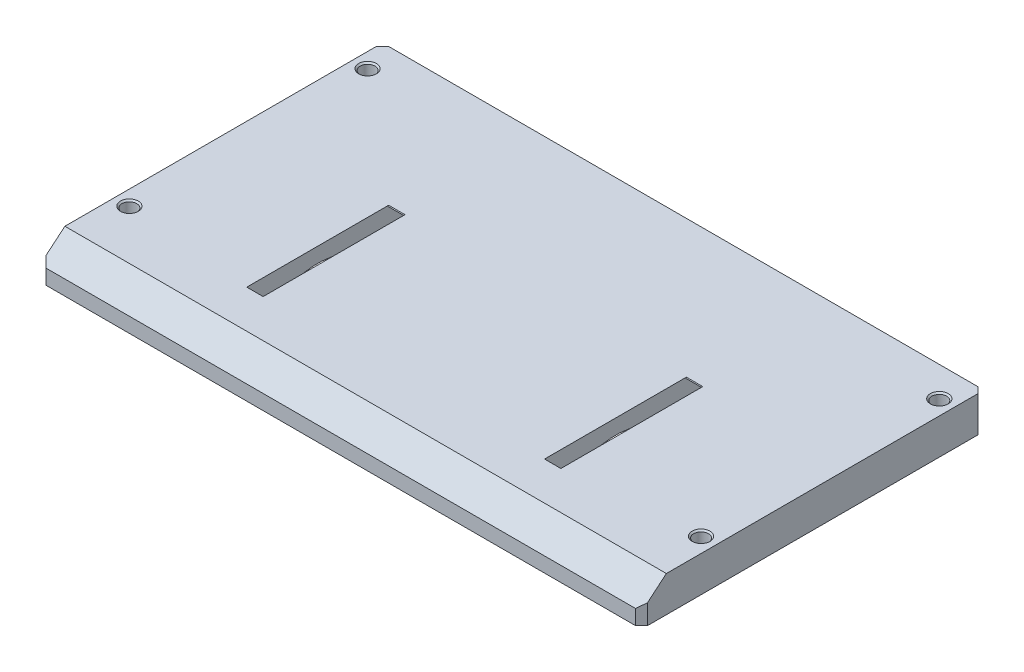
ISO-10303-21;
HEADER;
FILE_DESCRIPTION(('STEP AP214'),'2;1');
FILE_NAME('part.step','',(''),(''),'','','');
FILE_SCHEMA(('AUTOMOTIVE_DESIGN { 1 0 10303 214 1 1 1 1 }'));
ENDSEC;
DATA;
#1=APPLICATION_CONTEXT('core data for automotive mechanical design processes');
#2=APPLICATION_PROTOCOL_DEFINITION('international standard','automotive_design',2000,#1);
#3=PRODUCT_CONTEXT('',#1,'mechanical');
#4=PRODUCT('Part','Part','',(#3));
#5=PRODUCT_RELATED_PRODUCT_CATEGORY('part','',(#4));
#6=PRODUCT_DEFINITION_FORMATION('','',#4);
#7=PRODUCT_DEFINITION_CONTEXT('part definition',#1,'design');
#8=PRODUCT_DEFINITION('design','',#6,#7);
#9=PRODUCT_DEFINITION_SHAPE('','',#8);
#10=(LENGTH_UNIT() NAMED_UNIT(*) SI_UNIT(.MILLI.,.METRE.));
#11=(NAMED_UNIT(*) PLANE_ANGLE_UNIT() SI_UNIT($,.RADIAN.));
#12=(NAMED_UNIT(*) SI_UNIT($,.STERADIAN.) SOLID_ANGLE_UNIT());
#13=UNCERTAINTY_MEASURE_WITH_UNIT(LENGTH_MEASURE(1.E-05),#10,'distance_accuracy_value','');
#14=(GEOMETRIC_REPRESENTATION_CONTEXT(3) GLOBAL_UNCERTAINTY_ASSIGNED_CONTEXT((#13)) GLOBAL_UNIT_ASSIGNED_CONTEXT((#10,
#11,#12)) REPRESENTATION_CONTEXT('',''));
#15=CARTESIAN_POINT('',(0.,0.,0.));
#16=DIRECTION('',(0.,0.,1.));
#17=DIRECTION('',(1.,0.,0.));
#18=AXIS2_PLACEMENT_3D('',#15,#16,#17);
#19=CARTESIAN_POINT('',(0.,12.,0.));
#20=DIRECTION('',(0.,1.,0.));
#21=DIRECTION('',(0.,0.,1.));
#22=AXIS2_PLACEMENT_3D('',#19,#20,#21);
#23=PLANE('',#22);
#24=CARTESIAN_POINT('',(96.,12.,32.5));
#25=DIRECTION('',(0.,1.,0.));
#26=DIRECTION('',(0.,0.,1.));
#27=AXIS2_PLACEMENT_3D('',#24,#25,#26);
#28=CIRCLE('',#27,3.00000000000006);
#29=CARTESIAN_POINT('',(96.,12.,35.5));
#30=VERTEX_POINT('',#29);
#31=EDGE_CURVE('E388',#30,#30,#28,.F.);
#32=ORIENTED_EDGE('',*,*,#31,.T.);
#33=EDGE_LOOP('',(#32));
#34=FACE_BOUND('',#33,.T.);
#35=CARTESIAN_POINT('',(96.,12.,-47.5));
#36=DIRECTION('',(0.,1.,0.));
#37=DIRECTION('',(0.,0.,1.));
#38=AXIS2_PLACEMENT_3D('',#35,#36,#37);
#39=CIRCLE('',#38,3.00000000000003);
#40=CARTESIAN_POINT('',(96.,12.,-44.5));
#41=VERTEX_POINT('',#40);
#42=EDGE_CURVE('E385',#41,#41,#39,.F.);
#43=ORIENTED_EDGE('',*,*,#42,.T.);
#44=EDGE_LOOP('',(#43));
#45=FACE_BOUND('',#44,.T.);
#46=CARTESIAN_POINT('',(-96.,12.,32.5));
#47=DIRECTION('',(0.,1.,0.));
#48=DIRECTION('',(0.,0.,1.));
#49=AXIS2_PLACEMENT_3D('',#46,#47,#48);
#50=CIRCLE('',#49,3.00000000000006);
#51=CARTESIAN_POINT('',(-96.,12.,35.5));
#52=VERTEX_POINT('',#51);
#53=EDGE_CURVE('E382',#52,#52,#50,.F.);
#54=ORIENTED_EDGE('',*,*,#53,.T.);
#55=EDGE_LOOP('',(#54));
#56=FACE_BOUND('',#55,.T.);
#57=CARTESIAN_POINT('',(-96.,12.,-47.5));
#58=DIRECTION('',(0.,1.,0.));
#59=DIRECTION('',(0.,0.,1.));
#60=AXIS2_PLACEMENT_3D('',#57,#58,#59);
#61=CIRCLE('',#60,3.00000000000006);
#62=CARTESIAN_POINT('',(-96.,12.,-44.5));
#63=VERTEX_POINT('',#62);
#64=EDGE_CURVE('E379',#63,#63,#61,.F.);
#65=ORIENTED_EDGE('',*,*,#64,.T.);
#66=EDGE_LOOP('',(#65));
#67=FACE_BOUND('',#66,.T.);
#68=DIRECTION('',(0.,0.,1.));
#69=VECTOR('',#68,1.);
#70=CARTESIAN_POINT('',(-101.,12.,57.5));
#71=LINE('',#70,#69);
#72=CARTESIAN_POINT('',(-101.,12.,-55.5));
#73=VERTEX_POINT('',#72);
#74=CARTESIAN_POINT('',(-101.,12.,49.1577248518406));
#75=VERTEX_POINT('',#74);
#76=EDGE_CURVE('E338',#73,#75,#71,.T.);
#77=ORIENTED_EDGE('',*,*,#76,.T.);
#78=DIRECTION('',(1.,0.,0.));
#79=VECTOR('',#78,1.);
#80=CARTESIAN_POINT('',(99.,12.,49.1577248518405));
#81=LINE('',#80,#79);
#82=CARTESIAN_POINT('',(101.,12.,49.1577248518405));
#83=VERTEX_POINT('',#82);
#84=EDGE_CURVE('E271',#75,#83,#81,.T.);
#85=ORIENTED_EDGE('',*,*,#84,.T.);
#86=DIRECTION('',(0.,0.,-1.));
#87=VECTOR('',#86,1.);
#88=CARTESIAN_POINT('',(101.,12.,57.5));
#89=LINE('',#88,#87);
#90=CARTESIAN_POINT('',(101.,12.,-55.5));
#91=VERTEX_POINT('',#90);
#92=EDGE_CURVE('E341',#83,#91,#89,.T.);
#93=ORIENTED_EDGE('',*,*,#92,.T.);
#94=DIRECTION('',(0.707106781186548,0.,0.707106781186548));
#95=VECTOR('',#94,1.);
#96=CARTESIAN_POINT('',(78.25,12.,-78.25));
#97=LINE('',#96,#95);
#98=CARTESIAN_POINT('',(99.,12.,-57.5));
#99=VERTEX_POINT('',#98);
#100=EDGE_CURVE('E430',#91,#99,#97,.F.);
#101=ORIENTED_EDGE('',*,*,#100,.T.);
#102=DIRECTION('',(-1.,0.,0.));
#103=VECTOR('',#102,1.);
#104=CARTESIAN_POINT('',(101.,12.,-57.5));
#105=LINE('',#104,#103);
#106=CARTESIAN_POINT('',(-99.,12.,-57.5));
#107=VERTEX_POINT('',#106);
#108=EDGE_CURVE('E344',#99,#107,#105,.T.);
#109=ORIENTED_EDGE('',*,*,#108,.T.);
#110=DIRECTION('',(0.707106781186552,0.,-0.707106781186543));
#111=VECTOR('',#110,1.);
#112=CARTESIAN_POINT('',(-78.2499999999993,12.,-78.2500000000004));
#113=LINE('',#112,#111);
#114=EDGE_CURVE('E432',#107,#73,#113,.F.);
#115=ORIENTED_EDGE('',*,*,#114,.T.);
#116=EDGE_LOOP('',(#77,#85,#93,#101,#109,#115));
#117=FACE_BOUND('',#116,.T.);
#118=DIRECTION('',(0.,0.,-1.));
#119=VECTOR('',#118,1.);
#120=CARTESIAN_POINT('',(47.25,12.,0.));
#121=LINE('',#120,#119);
#122=CARTESIAN_POINT('',(47.25,12.,36.3238075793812));
#123=VERTEX_POINT('',#122);
#124=CARTESIAN_POINT('',(47.25,12.,-11.3238075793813));
#125=VERTEX_POINT('',#124);
#126=EDGE_CURVE('E335',#123,#125,#121,.T.);
#127=ORIENTED_EDGE('',*,*,#126,.T.);
#128=DIRECTION('',(1.,0.,0.));
#129=VECTOR('',#128,1.);
#130=CARTESIAN_POINT('',(52.75,12.,-11.3238075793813));
#131=LINE('',#130,#129);
#132=CARTESIAN_POINT('',(52.75,12.,-11.3238075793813));
#133=VERTEX_POINT('',#132);
#134=EDGE_CURVE('E484',#125,#133,#131,.T.);
#135=ORIENTED_EDGE('',*,*,#134,.T.);
#136=DIRECTION('',(0.,0.,-1.));
#137=VECTOR('',#136,1.);
#138=CARTESIAN_POINT('',(52.75,12.,0.));
#139=LINE('',#138,#137);
#140=CARTESIAN_POINT('',(52.75,12.,36.3238075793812));
#141=VERTEX_POINT('',#140);
#142=EDGE_CURVE('E333',#141,#133,#139,.T.);
#143=ORIENTED_EDGE('',*,*,#142,.F.);
#144=DIRECTION('',(-1.,0.,0.));
#145=VECTOR('',#144,1.);
#146=CARTESIAN_POINT('',(47.25,12.,36.3238075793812));
#147=LINE('',#146,#145);
#148=EDGE_CURVE('E481',#141,#123,#147,.T.);
#149=ORIENTED_EDGE('',*,*,#148,.T.);
#150=EDGE_LOOP('',(#127,#135,#143,#149));
#151=FACE_BOUND('',#150,.T.);
#152=DIRECTION('',(-1.,0.,0.));
#153=VECTOR('',#152,1.);
#154=CARTESIAN_POINT('',(0.,12.,36.3238075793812));
#155=LINE('',#154,#153);
#156=CARTESIAN_POINT('',(-47.25,12.,36.3238075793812));
#157=VERTEX_POINT('',#156);
#158=CARTESIAN_POINT('',(-52.75,12.,36.3238075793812));
#159=VERTEX_POINT('',#158);
#160=EDGE_CURVE('E490',#157,#159,#155,.T.);
#161=ORIENTED_EDGE('',*,*,#160,.T.);
#162=DIRECTION('',(0.,0.,1.));
#163=VECTOR('',#162,1.);
#164=CARTESIAN_POINT('',(-52.75,12.,0.));
#165=LINE('',#164,#163);
#166=CARTESIAN_POINT('',(-52.75,12.,-11.3238075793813));
#167=VERTEX_POINT('',#166);
#168=EDGE_CURVE('E321',#167,#159,#165,.T.);
#169=ORIENTED_EDGE('',*,*,#168,.F.);
#170=DIRECTION('',(1.,0.,0.));
#171=VECTOR('',#170,1.);
#172=CARTESIAN_POINT('',(0.,12.,-11.3238075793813));
#173=LINE('',#172,#171);
#174=CARTESIAN_POINT('',(-47.25,12.,-11.3238075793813));
#175=VERTEX_POINT('',#174);
#176=EDGE_CURVE('E487',#167,#175,#173,.T.);
#177=ORIENTED_EDGE('',*,*,#176,.T.);
#178=DIRECTION('',(0.,0.,1.));
#179=VECTOR('',#178,1.);
#180=CARTESIAN_POINT('',(-47.25,12.,0.));
#181=LINE('',#180,#179);
#182=EDGE_CURVE('E323',#175,#157,#181,.T.);
#183=ORIENTED_EDGE('',*,*,#182,.T.);
#184=EDGE_LOOP('',(#161,#169,#177,#183));
#185=FACE_BOUND('',#184,.T.);
#186=ADVANCED_FACE('F56',(#34,#45,#56,#67,#117,#151,#185),#23,.T.);
#187=CARTESIAN_POINT('',(0.,0.,0.));
#188=DIRECTION('',(0.,1.,0.));
#189=DIRECTION('',(0.,0.,1.));
#190=AXIS2_PLACEMENT_3D('',#187,#188,#189);
#191=PLANE('',#190);
#192=DIRECTION('',(0.,0.,1.));
#193=VECTOR('',#192,1.);
#194=CARTESIAN_POINT('',(-47.25,0.,0.));
#195=LINE('',#194,#193);
#196=CARTESIAN_POINT('',(-47.25,0.,29.8493515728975));
#197=VERTEX_POINT('',#196);
#198=CARTESIAN_POINT('',(-47.25,0.,46.466401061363));
#199=VERTEX_POINT('',#198);
#200=EDGE_CURVE('E454',#197,#199,#195,.T.);
#201=ORIENTED_EDGE('',*,*,#200,.F.);
#202=DIRECTION('',(1.,0.,0.));
#203=VECTOR('',#202,1.);
#204=CARTESIAN_POINT('',(-75.,0.,29.8493515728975));
#205=LINE('',#204,#203);
#206=CARTESIAN_POINT('',(47.25,0.,29.8493515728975));
#207=VERTEX_POINT('',#206);
#208=EDGE_CURVE('E293',#197,#207,#205,.T.);
#209=ORIENTED_EDGE('',*,*,#208,.T.);
#210=DIRECTION('',(0.,0.,-1.));
#211=VECTOR('',#210,1.);
#212=CARTESIAN_POINT('',(47.25,0.,0.));
#213=LINE('',#212,#211);
#214=CARTESIAN_POINT('',(47.25,0.,46.466401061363));
#215=VERTEX_POINT('',#214);
#216=EDGE_CURVE('E449',#215,#207,#213,.T.);
#217=ORIENTED_EDGE('',*,*,#216,.F.);
#218=DIRECTION('',(1.,0.,0.));
#219=VECTOR('',#218,1.);
#220=CARTESIAN_POINT('',(0.,0.,46.466401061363));
#221=LINE('',#220,#219);
#222=CARTESIAN_POINT('',(52.75,0.,46.466401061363));
#223=VERTEX_POINT('',#222);
#224=EDGE_CURVE('E462',#215,#223,#221,.T.);
#225=ORIENTED_EDGE('',*,*,#224,.T.);
#226=DIRECTION('',(0.,0.,-1.));
#227=VECTOR('',#226,1.);
#228=CARTESIAN_POINT('',(52.75,0.,0.));
#229=LINE('',#228,#227);
#230=CARTESIAN_POINT('',(52.75,0.,29.8493515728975));
#231=VERTEX_POINT('',#230);
#232=EDGE_CURVE('E445',#223,#231,#229,.T.);
#233=ORIENTED_EDGE('',*,*,#232,.T.);
#234=CARTESIAN_POINT('',(75.,0.,29.8493515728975));
#235=VERTEX_POINT('',#234);
#236=EDGE_CURVE('E292',#231,#235,#205,.T.);
#237=ORIENTED_EDGE('',*,*,#236,.T.);
#238=DIRECTION('',(0.,0.,-1.));
#239=VECTOR('',#238,1.);
#240=CARTESIAN_POINT('',(75.,0.,0.));
#241=LINE('',#240,#239);
#242=CARTESIAN_POINT('',(75.,0.,-4.8493515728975));
#243=VERTEX_POINT('',#242);
#244=EDGE_CURVE('E272',#235,#243,#241,.T.);
#245=ORIENTED_EDGE('',*,*,#244,.T.);
#246=DIRECTION('',(1.,0.,0.));
#247=VECTOR('',#246,1.);
#248=CARTESIAN_POINT('',(-75.,0.,-4.8493515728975));
#249=LINE('',#248,#247);
#250=CARTESIAN_POINT('',(52.75,0.,-4.8493515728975));
#251=VERTEX_POINT('',#250);
#252=EDGE_CURVE('E288',#243,#251,#249,.F.);
#253=ORIENTED_EDGE('',*,*,#252,.T.);
#254=CARTESIAN_POINT('',(52.75,0.,-21.4664010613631));
#255=VERTEX_POINT('',#254);
#256=EDGE_CURVE('E444',#251,#255,#229,.T.);
#257=ORIENTED_EDGE('',*,*,#256,.T.);
#258=DIRECTION('',(-1.,0.,0.));
#259=VECTOR('',#258,1.);
#260=CARTESIAN_POINT('',(0.,0.,-21.4664010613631));
#261=LINE('',#260,#259);
#262=CARTESIAN_POINT('',(47.25,0.,-21.4664010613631));
#263=VERTEX_POINT('',#262);
#264=EDGE_CURVE('E465',#255,#263,#261,.T.);
#265=ORIENTED_EDGE('',*,*,#264,.T.);
#266=CARTESIAN_POINT('',(47.25,0.,-4.8493515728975));
#267=VERTEX_POINT('',#266);
#268=EDGE_CURVE('E448',#267,#263,#213,.T.);
#269=ORIENTED_EDGE('',*,*,#268,.F.);
#270=CARTESIAN_POINT('',(-47.25,0.,-4.8493515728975));
#271=VERTEX_POINT('',#270);
#272=EDGE_CURVE('E289',#267,#271,#249,.F.);
#273=ORIENTED_EDGE('',*,*,#272,.T.);
#274=CARTESIAN_POINT('',(-47.25,0.,-21.4664010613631));
#275=VERTEX_POINT('',#274);
#276=EDGE_CURVE('E455',#275,#271,#195,.T.);
#277=ORIENTED_EDGE('',*,*,#276,.F.);
#278=DIRECTION('',(-1.,0.,0.));
#279=VECTOR('',#278,1.);
#280=CARTESIAN_POINT('',(-52.75,0.,-21.4664010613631));
#281=LINE('',#280,#279);
#282=CARTESIAN_POINT('',(-52.75,0.,-21.4664010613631));
#283=VERTEX_POINT('',#282);
#284=EDGE_CURVE('E473',#275,#283,#281,.T.);
#285=ORIENTED_EDGE('',*,*,#284,.T.);
#286=DIRECTION('',(0.,0.,1.));
#287=VECTOR('',#286,1.);
#288=CARTESIAN_POINT('',(-52.75,0.,0.));
#289=LINE('',#288,#287);
#290=CARTESIAN_POINT('',(-52.75,0.,-4.8493515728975));
#291=VERTEX_POINT('',#290);
#292=EDGE_CURVE('E286',#283,#291,#289,.T.);
#293=ORIENTED_EDGE('',*,*,#292,.T.);
#294=CARTESIAN_POINT('',(-75.,0.,-4.8493515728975));
#295=VERTEX_POINT('',#294);
#296=EDGE_CURVE('E276',#291,#295,#249,.F.);
#297=ORIENTED_EDGE('',*,*,#296,.T.);
#298=DIRECTION('',(0.,0.,-1.));
#299=VECTOR('',#298,1.);
#300=CARTESIAN_POINT('',(-75.,0.,0.));
#301=LINE('',#300,#299);
#302=CARTESIAN_POINT('',(-75.,0.,29.8493515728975));
#303=VERTEX_POINT('',#302);
#304=EDGE_CURVE('E264',#303,#295,#301,.T.);
#305=ORIENTED_EDGE('',*,*,#304,.F.);
#306=CARTESIAN_POINT('',(-52.75,0.,29.8493515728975));
#307=VERTEX_POINT('',#306);
#308=EDGE_CURVE('E278',#303,#307,#205,.T.);
#309=ORIENTED_EDGE('',*,*,#308,.T.);
#310=CARTESIAN_POINT('',(-52.75,0.,46.466401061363));
#311=VERTEX_POINT('',#310);
#312=EDGE_CURVE('E452',#307,#311,#289,.T.);
#313=ORIENTED_EDGE('',*,*,#312,.T.);
#314=DIRECTION('',(1.,0.,0.));
#315=VECTOR('',#314,1.);
#316=CARTESIAN_POINT('',(-47.25,0.,46.466401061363));
#317=LINE('',#316,#315);
#318=EDGE_CURVE('E469',#311,#199,#317,.T.);
#319=ORIENTED_EDGE('',*,*,#318,.T.);
#320=EDGE_LOOP('',(#201,#209,#217,#225,#233,#237,#245,#253,#257,#265,#269,#273,#277,#285,#293,
#297,#305,#309,#313,#319));
#321=FACE_BOUND('',#320,.T.);
#322=CARTESIAN_POINT('',(96.,0.,32.5));
#323=DIRECTION('',(0.,1.,0.));
#324=DIRECTION('',(0.,0.,1.));
#325=AXIS2_PLACEMENT_3D('',#322,#323,#324);
#326=CIRCLE('',#325,3.);
#327=CARTESIAN_POINT('',(96.,0.,35.5));
#328=VERTEX_POINT('',#327);
#329=EDGE_CURVE('E370',#328,#328,#326,.T.);
#330=ORIENTED_EDGE('',*,*,#329,.T.);
#331=EDGE_LOOP('',(#330));
#332=FACE_BOUND('',#331,.T.);
#333=CARTESIAN_POINT('',(96.,0.,-47.5));
#334=DIRECTION('',(0.,1.,0.));
#335=DIRECTION('',(0.,0.,1.));
#336=AXIS2_PLACEMENT_3D('',#333,#334,#335);
#337=CIRCLE('',#336,2.99999999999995);
#338=CARTESIAN_POINT('',(96.,0.,-44.5000000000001));
#339=VERTEX_POINT('',#338);
#340=EDGE_CURVE('E366',#339,#339,#337,.T.);
#341=ORIENTED_EDGE('',*,*,#340,.T.);
#342=EDGE_LOOP('',(#341));
#343=FACE_BOUND('',#342,.T.);
#344=CARTESIAN_POINT('',(-96.,0.,32.5));
#345=DIRECTION('',(0.,1.,0.));
#346=DIRECTION('',(0.,0.,1.));
#347=AXIS2_PLACEMENT_3D('',#344,#345,#346);
#348=CIRCLE('',#347,3.);
#349=CARTESIAN_POINT('',(-96.,0.,35.5));
#350=VERTEX_POINT('',#349);
#351=EDGE_CURVE('E363',#350,#350,#348,.T.);
#352=ORIENTED_EDGE('',*,*,#351,.T.);
#353=EDGE_LOOP('',(#352));
#354=FACE_BOUND('',#353,.T.);
#355=CARTESIAN_POINT('',(-96.,0.,-47.5));
#356=DIRECTION('',(0.,1.,0.));
#357=DIRECTION('',(0.,0.,1.));
#358=AXIS2_PLACEMENT_3D('',#355,#356,#357);
#359=CIRCLE('',#358,3.00000000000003);
#360=CARTESIAN_POINT('',(-96.,0.,-44.5));
#361=VERTEX_POINT('',#360);
#362=EDGE_CURVE('E348',#361,#361,#359,.T.);
#363=ORIENTED_EDGE('',*,*,#362,.T.);
#364=EDGE_LOOP('',(#363));
#365=FACE_BOUND('',#364,.T.);
#366=DIRECTION('',(0.,0.,1.));
#367=VECTOR('',#366,1.);
#368=CARTESIAN_POINT('',(-101.,0.,57.5));
#369=LINE('',#368,#367);
#370=CARTESIAN_POINT('',(-101.,0.,-55.5));
#371=VERTEX_POINT('',#370);
#372=CARTESIAN_POINT('',(-101.,0.,55.5));
#373=VERTEX_POINT('',#372);
#374=EDGE_CURVE('E337',#371,#373,#369,.T.);
#375=ORIENTED_EDGE('',*,*,#374,.F.);
#376=DIRECTION('',(-0.707106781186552,0.,0.707106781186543));
#377=VECTOR('',#376,1.);
#378=CARTESIAN_POINT('',(-101.,0.,-55.5));
#379=LINE('',#378,#377);
#380=CARTESIAN_POINT('',(-99.,0.,-57.5));
#381=VERTEX_POINT('',#380);
#382=EDGE_CURVE('E422',#371,#381,#379,.F.);
#383=ORIENTED_EDGE('',*,*,#382,.T.);
#384=DIRECTION('',(-1.,0.,0.));
#385=VECTOR('',#384,1.);
#386=CARTESIAN_POINT('',(101.,0.,-57.5));
#387=LINE('',#386,#385);
#388=CARTESIAN_POINT('',(99.,0.,-57.5));
#389=VERTEX_POINT('',#388);
#390=EDGE_CURVE('E342',#389,#381,#387,.T.);
#391=ORIENTED_EDGE('',*,*,#390,.F.);
#392=DIRECTION('',(-0.707106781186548,0.,-0.707106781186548));
#393=VECTOR('',#392,1.);
#394=CARTESIAN_POINT('',(99.,0.,-57.5));
#395=LINE('',#394,#393);
#396=CARTESIAN_POINT('',(101.,0.,-55.5));
#397=VERTEX_POINT('',#396);
#398=EDGE_CURVE('E415',#389,#397,#395,.F.);
#399=ORIENTED_EDGE('',*,*,#398,.T.);
#400=DIRECTION('',(0.,0.,-1.));
#401=VECTOR('',#400,1.);
#402=CARTESIAN_POINT('',(101.,0.,57.5));
#403=LINE('',#402,#401);
#404=CARTESIAN_POINT('',(101.,0.,55.5));
#405=VERTEX_POINT('',#404);
#406=EDGE_CURVE('E355',#405,#397,#403,.T.);
#407=ORIENTED_EDGE('',*,*,#406,.F.);
#408=DIRECTION('',(0.707106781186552,0.,-0.707106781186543));
#409=VECTOR('',#408,1.);
#410=CARTESIAN_POINT('',(101.,0.,55.5));
#411=LINE('',#410,#409);
#412=CARTESIAN_POINT('',(99.,0.,57.5));
#413=VERTEX_POINT('',#412);
#414=EDGE_CURVE('E418',#405,#413,#411,.F.);
#415=ORIENTED_EDGE('',*,*,#414,.T.);
#416=DIRECTION('',(1.,0.,0.));
#417=VECTOR('',#416,1.);
#418=CARTESIAN_POINT('',(101.,0.,57.5));
#419=LINE('',#418,#417);
#420=CARTESIAN_POINT('',(-99.,0.,57.5));
#421=VERTEX_POINT('',#420);
#422=EDGE_CURVE('E351',#421,#413,#419,.T.);
#423=ORIENTED_EDGE('',*,*,#422,.F.);
#424=DIRECTION('',(0.707106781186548,0.,0.707106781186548));
#425=VECTOR('',#424,1.);
#426=CARTESIAN_POINT('',(-99.,0.,57.5));
#427=LINE('',#426,#425);
#428=EDGE_CURVE('E420',#421,#373,#427,.F.);
#429=ORIENTED_EDGE('',*,*,#428,.T.);
#430=EDGE_LOOP('',(#375,#383,#391,#399,#407,#415,#423,#429));
#431=FACE_BOUND('',#430,.T.);
#432=ADVANCED_FACE('F283',(#321,#332,#343,#354,#365,#431),#191,.F.);
#433=CARTESIAN_POINT('',(-101.,12.,57.5));
#434=DIRECTION('',(1.,0.,0.));
#435=DIRECTION('',(0.,0.,-1.));
#436=AXIS2_PLACEMENT_3D('',#433,#434,#435);
#437=PLANE('',#436);
#438=DIRECTION('',(0.,1.,0.));
#439=VECTOR('',#438,1.);
#440=CARTESIAN_POINT('',(-101.,12.,55.5));
#441=LINE('',#440,#439);
#442=CARTESIAN_POINT('',(-101.,6.67819926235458,55.5));
#443=VERTEX_POINT('',#442);
#444=EDGE_CURVE('E410',#373,#443,#441,.T.);
#445=ORIENTED_EDGE('',*,*,#444,.T.);
#446=DIRECTION('',(0.,0.642787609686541,-0.766044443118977));
#447=VECTOR('',#446,1.);
#448=CARTESIAN_POINT('',(-101.,12.,49.1577248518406));
#449=LINE('',#448,#447);
#450=EDGE_CURVE('E13',#443,#75,#449,.T.);
#451=ORIENTED_EDGE('',*,*,#450,.T.);
#452=ORIENTED_EDGE('',*,*,#76,.F.);
#453=DIRECTION('',(0.,-1.,0.));
#454=VECTOR('',#453,1.);
#455=CARTESIAN_POINT('',(-101.,12.,-55.5));
#456=LINE('',#455,#454);
#457=EDGE_CURVE('E412',#73,#371,#456,.T.);
#458=ORIENTED_EDGE('',*,*,#457,.T.);
#459=ORIENTED_EDGE('',*,*,#374,.T.);
#460=EDGE_LOOP('',(#445,#451,#452,#458,#459));
#461=FACE_BOUND('',#460,.T.);
#462=ADVANCED_FACE('F653',(#461),#437,.F.);
#463=CARTESIAN_POINT('',(101.,12.,57.5));
#464=DIRECTION('',(0.,0.,-1.));
#465=DIRECTION('',(-1.,0.,0.));
#466=AXIS2_PLACEMENT_3D('',#463,#464,#465);
#467=PLANE('',#466);
#468=DIRECTION('',(0.,1.,0.));
#469=VECTOR('',#468,1.);
#470=CARTESIAN_POINT('',(99.,12.,57.5));
#471=LINE('',#470,#469);
#472=CARTESIAN_POINT('',(99.,5.,57.5));
#473=VERTEX_POINT('',#472);
#474=EDGE_CURVE('E434',#413,#473,#471,.T.);
#475=ORIENTED_EDGE('',*,*,#474,.T.);
#476=DIRECTION('',(-1.,0.,0.));
#477=VECTOR('',#476,1.);
#478=CARTESIAN_POINT('',(-99.,5.,57.5));
#479=LINE('',#478,#477);
#480=CARTESIAN_POINT('',(-99.,5.,57.5));
#481=VERTEX_POINT('',#480);
#482=EDGE_CURVE('E78',#473,#481,#479,.T.);
#483=ORIENTED_EDGE('',*,*,#482,.T.);
#484=DIRECTION('',(0.,-1.,0.));
#485=VECTOR('',#484,1.);
#486=CARTESIAN_POINT('',(-99.,12.,57.5));
#487=LINE('',#486,#485);
#488=EDGE_CURVE('E436',#481,#421,#487,.T.);
#489=ORIENTED_EDGE('',*,*,#488,.T.);
#490=ORIENTED_EDGE('',*,*,#422,.T.);
#491=EDGE_LOOP('',(#475,#483,#489,#490));
#492=FACE_BOUND('',#491,.T.);
#493=ADVANCED_FACE('F667',(#492),#467,.F.);
#494=CARTESIAN_POINT('',(101.,12.,57.5));
#495=DIRECTION('',(-1.,0.,0.));
#496=DIRECTION('',(0.,0.,1.));
#497=AXIS2_PLACEMENT_3D('',#494,#495,#496);
#498=PLANE('',#497);
#499=ORIENTED_EDGE('',*,*,#92,.F.);
#500=DIRECTION('',(0.,-0.642787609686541,0.766044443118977));
#501=VECTOR('',#500,1.);
#502=CARTESIAN_POINT('',(101.,12.,49.1577248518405));
#503=LINE('',#502,#501);
#504=CARTESIAN_POINT('',(101.,6.67819926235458,55.5));
#505=VERTEX_POINT('',#504);
#506=EDGE_CURVE('E552',#83,#505,#503,.T.);
#507=ORIENTED_EDGE('',*,*,#506,.T.);
#508=DIRECTION('',(0.,-1.,0.));
#509=VECTOR('',#508,1.);
#510=CARTESIAN_POINT('',(101.,12.,55.5));
#511=LINE('',#510,#509);
#512=EDGE_CURVE('E442',#505,#405,#511,.T.);
#513=ORIENTED_EDGE('',*,*,#512,.T.);
#514=ORIENTED_EDGE('',*,*,#406,.T.);
#515=DIRECTION('',(0.,1.,0.));
#516=VECTOR('',#515,1.);
#517=CARTESIAN_POINT('',(101.,12.,-55.5));
#518=LINE('',#517,#516);
#519=EDGE_CURVE('E438',#397,#91,#518,.T.);
#520=ORIENTED_EDGE('',*,*,#519,.T.);
#521=EDGE_LOOP('',(#499,#507,#513,#514,#520));
#522=FACE_BOUND('',#521,.T.);
#523=ADVANCED_FACE('F663',(#522),#498,.F.);
#524=CARTESIAN_POINT('',(101.,12.,-57.5));
#525=DIRECTION('',(0.,0.,1.));
#526=DIRECTION('',(1.,0.,0.));
#527=AXIS2_PLACEMENT_3D('',#524,#525,#526);
#528=PLANE('',#527);
#529=ORIENTED_EDGE('',*,*,#390,.T.);
#530=DIRECTION('',(0.,1.,0.));
#531=VECTOR('',#530,1.);
#532=CARTESIAN_POINT('',(-99.,12.,-57.5));
#533=LINE('',#532,#531);
#534=EDGE_CURVE('E428',#381,#107,#533,.T.);
#535=ORIENTED_EDGE('',*,*,#534,.T.);
#536=ORIENTED_EDGE('',*,*,#108,.F.);
#537=DIRECTION('',(0.,-1.,0.));
#538=VECTOR('',#537,1.);
#539=CARTESIAN_POINT('',(99.,12.,-57.5));
#540=LINE('',#539,#538);
#541=EDGE_CURVE('E424',#99,#389,#540,.T.);
#542=ORIENTED_EDGE('',*,*,#541,.T.);
#543=EDGE_LOOP('',(#529,#535,#536,#542));
#544=FACE_BOUND('',#543,.T.);
#545=ADVANCED_FACE('F660',(#544),#528,.F.);
#546=CARTESIAN_POINT('',(96.,12.,-47.5));
#547=DIRECTION('',(0.,-1.,0.));
#548=DIRECTION('',(0.,0.,-1.));
#549=AXIS2_PLACEMENT_3D('',#546,#547,#548);
#550=CYLINDRICAL_SURFACE('',#549,2.5);
#551=CARTESIAN_POINT('',(96.,0.499999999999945,-47.5));
#552=DIRECTION('',(0.,1.,0.));
#553=DIRECTION('',(0.,0.,1.));
#554=AXIS2_PLACEMENT_3D('',#551,#552,#553);
#555=CIRCLE('',#554,2.5);
#556=CARTESIAN_POINT('',(96.,0.499999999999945,-45.));
#557=VERTEX_POINT('',#556);
#558=EDGE_CURVE('E394',#557,#557,#555,.F.);
#559=ORIENTED_EDGE('',*,*,#558,.T.);
#560=EDGE_LOOP('',(#559));
#561=FACE_BOUND('',#560,.T.);
#562=CARTESIAN_POINT('',(96.,11.5,-47.5));
#563=DIRECTION('',(0.,1.,0.));
#564=DIRECTION('',(0.,0.,1.));
#565=AXIS2_PLACEMENT_3D('',#562,#563,#564);
#566=CIRCLE('',#565,2.5);
#567=CARTESIAN_POINT('',(96.,11.5,-45.));
#568=VERTEX_POINT('',#567);
#569=EDGE_CURVE('E391',#568,#568,#566,.T.);
#570=ORIENTED_EDGE('',*,*,#569,.T.);
#571=EDGE_LOOP('',(#570));
#572=FACE_BOUND('',#571,.T.);
#573=ADVANCED_FACE('F657',(#561,#572),#550,.F.);
#574=CARTESIAN_POINT('',(96.,12.,32.5));
#575=DIRECTION('',(0.,-1.,0.));
#576=DIRECTION('',(0.,0.,-1.));
#577=AXIS2_PLACEMENT_3D('',#574,#575,#576);
#578=CYLINDRICAL_SURFACE('',#577,2.49999999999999);
#579=CARTESIAN_POINT('',(96.,0.5,32.5));
#580=DIRECTION('',(0.,1.,0.));
#581=DIRECTION('',(0.,0.,1.));
#582=AXIS2_PLACEMENT_3D('',#579,#580,#581);
#583=CIRCLE('',#582,2.49999999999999);
#584=CARTESIAN_POINT('',(96.,0.5,35.));
#585=VERTEX_POINT('',#584);
#586=EDGE_CURVE('E376',#585,#585,#583,.F.);
#587=ORIENTED_EDGE('',*,*,#586,.T.);
#588=EDGE_LOOP('',(#587));
#589=FACE_BOUND('',#588,.T.);
#590=CARTESIAN_POINT('',(96.,11.5,32.5));
#591=DIRECTION('',(0.,1.,0.));
#592=DIRECTION('',(0.,0.,1.));
#593=AXIS2_PLACEMENT_3D('',#590,#591,#592);
#594=CIRCLE('',#593,2.49999999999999);
#595=CARTESIAN_POINT('',(96.,11.5,35.));
#596=VERTEX_POINT('',#595);
#597=EDGE_CURVE('E373',#596,#596,#594,.T.);
#598=ORIENTED_EDGE('',*,*,#597,.T.);
#599=EDGE_LOOP('',(#598));
#600=FACE_BOUND('',#599,.T.);
#601=ADVANCED_FACE('F926',(#589,#600),#578,.F.);
#602=CARTESIAN_POINT('',(-96.,12.,-47.5));
#603=DIRECTION('',(0.,-1.,0.));
#604=DIRECTION('',(0.,0.,-1.));
#605=AXIS2_PLACEMENT_3D('',#602,#603,#604);
#606=CYLINDRICAL_SURFACE('',#605,2.5);
#607=CARTESIAN_POINT('',(-96.,0.5,-47.5));
#608=DIRECTION('',(0.,1.,0.));
#609=DIRECTION('',(0.,0.,1.));
#610=AXIS2_PLACEMENT_3D('',#607,#608,#609);
#611=CIRCLE('',#610,2.5);
#612=CARTESIAN_POINT('',(-96.,0.5,-45.));
#613=VERTEX_POINT('',#612);
#614=EDGE_CURVE('E407',#613,#613,#611,.F.);
#615=ORIENTED_EDGE('',*,*,#614,.T.);
#616=EDGE_LOOP('',(#615));
#617=FACE_BOUND('',#616,.T.);
#618=CARTESIAN_POINT('',(-96.,11.5,-47.5));
#619=DIRECTION('',(0.,1.,0.));
#620=DIRECTION('',(0.,0.,1.));
#621=AXIS2_PLACEMENT_3D('',#618,#619,#620);
#622=CIRCLE('',#621,2.5);
#623=CARTESIAN_POINT('',(-96.,11.5,-45.));
#624=VERTEX_POINT('',#623);
#625=EDGE_CURVE('E404',#624,#624,#622,.T.);
#626=ORIENTED_EDGE('',*,*,#625,.T.);
#627=EDGE_LOOP('',(#626));
#628=FACE_BOUND('',#627,.T.);
#629=ADVANCED_FACE('F918',(#617,#628),#606,.F.);
#630=CARTESIAN_POINT('',(-96.,12.,32.5));
#631=DIRECTION('',(0.,-1.,0.));
#632=DIRECTION('',(0.,0.,-1.));
#633=AXIS2_PLACEMENT_3D('',#630,#631,#632);
#634=CYLINDRICAL_SURFACE('',#633,2.49999999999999);
#635=CARTESIAN_POINT('',(-96.,0.5,32.5));
#636=DIRECTION('',(0.,1.,0.));
#637=DIRECTION('',(0.,0.,1.));
#638=AXIS2_PLACEMENT_3D('',#635,#636,#637);
#639=CIRCLE('',#638,2.49999999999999);
#640=CARTESIAN_POINT('',(-96.,0.5,35.));
#641=VERTEX_POINT('',#640);
#642=EDGE_CURVE('E401',#641,#641,#639,.F.);
#643=ORIENTED_EDGE('',*,*,#642,.T.);
#644=EDGE_LOOP('',(#643));
#645=FACE_BOUND('',#644,.T.);
#646=CARTESIAN_POINT('',(-96.,11.5,32.5));
#647=DIRECTION('',(0.,1.,0.));
#648=DIRECTION('',(0.,0.,1.));
#649=AXIS2_PLACEMENT_3D('',#646,#647,#648);
#650=CIRCLE('',#649,2.49999999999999);
#651=CARTESIAN_POINT('',(-96.,11.5,35.));
#652=VERTEX_POINT('',#651);
#653=EDGE_CURVE('E398',#652,#652,#650,.T.);
#654=ORIENTED_EDGE('',*,*,#653,.T.);
#655=EDGE_LOOP('',(#654));
#656=FACE_BOUND('',#655,.T.);
#657=ADVANCED_FACE('F678',(#645,#656),#634,.F.);
#658=CARTESIAN_POINT('',(96.,0.,32.5));
#659=DIRECTION('',(0.,-1.,0.));
#660=DIRECTION('',(0.,0.,-1.));
#661=AXIS2_PLACEMENT_3D('',#658,#659,#660);
#662=CONICAL_SURFACE('',#661,3.,0.785398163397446);
#663=ORIENTED_EDGE('',*,*,#586,.F.);
#664=EDGE_LOOP('',(#663));
#665=FACE_BOUND('',#664,.T.);
#666=ORIENTED_EDGE('',*,*,#329,.F.);
#667=EDGE_LOOP('',(#666));
#668=FACE_BOUND('',#667,.T.);
#669=ADVANCED_FACE('F674',(#665,#668),#662,.F.);
#670=CARTESIAN_POINT('',(96.,11.5,32.5));
#671=DIRECTION('',(0.,1.,0.));
#672=DIRECTION('',(0.,0.,1.));
#673=AXIS2_PLACEMENT_3D('',#670,#671,#672);
#674=CONICAL_SURFACE('',#673,2.49999999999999,0.785398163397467);
#675=ORIENTED_EDGE('',*,*,#31,.F.);
#676=EDGE_LOOP('',(#675));
#677=FACE_BOUND('',#676,.T.);
#678=ORIENTED_EDGE('',*,*,#597,.F.);
#679=EDGE_LOOP('',(#678));
#680=FACE_BOUND('',#679,.T.);
#681=ADVANCED_FACE('F677',(#677,#680),#674,.F.);
#682=CARTESIAN_POINT('',(96.,0.,-47.5));
#683=DIRECTION('',(0.,-1.,0.));
#684=DIRECTION('',(0.,0.,-1.));
#685=AXIS2_PLACEMENT_3D('',#682,#683,#684);
#686=CONICAL_SURFACE('',#685,2.99999999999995,0.785398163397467);
#687=ORIENTED_EDGE('',*,*,#558,.F.);
#688=EDGE_LOOP('',(#687));
#689=FACE_BOUND('',#688,.T.);
#690=ORIENTED_EDGE('',*,*,#340,.F.);
#691=EDGE_LOOP('',(#690));
#692=FACE_BOUND('',#691,.T.);
#693=ADVANCED_FACE('F682',(#689,#692),#686,.F.);
#694=CARTESIAN_POINT('',(96.,11.5,-47.5));
#695=DIRECTION('',(0.,1.,0.));
#696=DIRECTION('',(0.,0.,1.));
#697=AXIS2_PLACEMENT_3D('',#694,#695,#696);
#698=CONICAL_SURFACE('',#697,2.5,0.785398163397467);
#699=ORIENTED_EDGE('',*,*,#42,.F.);
#700=EDGE_LOOP('',(#699));
#701=FACE_BOUND('',#700,.T.);
#702=ORIENTED_EDGE('',*,*,#569,.F.);
#703=EDGE_LOOP('',(#702));
#704=FACE_BOUND('',#703,.T.);
#705=ADVANCED_FACE('F686',(#701,#704),#698,.F.);
#706=CARTESIAN_POINT('',(-96.,0.,32.5));
#707=DIRECTION('',(0.,-1.,0.));
#708=DIRECTION('',(0.,0.,-1.));
#709=AXIS2_PLACEMENT_3D('',#706,#707,#708);
#710=CONICAL_SURFACE('',#709,3.,0.785398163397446);
#711=ORIENTED_EDGE('',*,*,#642,.F.);
#712=EDGE_LOOP('',(#711));
#713=FACE_BOUND('',#712,.T.);
#714=ORIENTED_EDGE('',*,*,#351,.F.);
#715=EDGE_LOOP('',(#714));
#716=FACE_BOUND('',#715,.T.);
#717=ADVANCED_FACE('F690',(#713,#716),#710,.F.);
#718=CARTESIAN_POINT('',(-96.,11.5,32.5));
#719=DIRECTION('',(0.,1.,0.));
#720=DIRECTION('',(0.,0.,1.));
#721=AXIS2_PLACEMENT_3D('',#718,#719,#720);
#722=CONICAL_SURFACE('',#721,2.49999999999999,0.785398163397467);
#723=ORIENTED_EDGE('',*,*,#53,.F.);
#724=EDGE_LOOP('',(#723));
#725=FACE_BOUND('',#724,.T.);
#726=ORIENTED_EDGE('',*,*,#653,.F.);
#727=EDGE_LOOP('',(#726));
#728=FACE_BOUND('',#727,.T.);
#729=ADVANCED_FACE('F694',(#725,#728),#722,.F.);
#730=CARTESIAN_POINT('',(-96.,0.,-47.5));
#731=DIRECTION('',(0.,-1.,0.));
#732=DIRECTION('',(0.,0.,-1.));
#733=AXIS2_PLACEMENT_3D('',#730,#731,#732);
#734=CONICAL_SURFACE('',#733,3.00000000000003,0.785398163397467);
#735=ORIENTED_EDGE('',*,*,#614,.F.);
#736=EDGE_LOOP('',(#735));
#737=FACE_BOUND('',#736,.T.);
#738=ORIENTED_EDGE('',*,*,#362,.F.);
#739=EDGE_LOOP('',(#738));
#740=FACE_BOUND('',#739,.T.);
#741=ADVANCED_FACE('F698',(#737,#740),#734,.F.);
#742=CARTESIAN_POINT('',(-96.,11.5,-47.5));
#743=DIRECTION('',(0.,1.,0.));
#744=DIRECTION('',(0.,0.,1.));
#745=AXIS2_PLACEMENT_3D('',#742,#743,#744);
#746=CONICAL_SURFACE('',#745,2.5,0.785398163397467);
#747=ORIENTED_EDGE('',*,*,#64,.F.);
#748=EDGE_LOOP('',(#747));
#749=FACE_BOUND('',#748,.T.);
#750=ORIENTED_EDGE('',*,*,#625,.F.);
#751=EDGE_LOOP('',(#750));
#752=FACE_BOUND('',#751,.T.);
#753=ADVANCED_FACE('F702',(#749,#752),#746,.F.);
#754=CARTESIAN_POINT('',(-101.,12.,-55.5));
#755=DIRECTION('',(0.707106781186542,0.,0.707106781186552));
#756=DIRECTION('',(0.,-1.,0.));
#757=AXIS2_PLACEMENT_3D('',#754,#755,#756);
#758=PLANE('',#757);
#759=ORIENTED_EDGE('',*,*,#114,.F.);
#760=ORIENTED_EDGE('',*,*,#534,.F.);
#761=ORIENTED_EDGE('',*,*,#382,.F.);
#762=ORIENTED_EDGE('',*,*,#457,.F.);
#763=EDGE_LOOP('',(#759,#760,#761,#762));
#764=FACE_BOUND('',#763,.T.);
#765=ADVANCED_FACE('F706',(#764),#758,.F.);
#766=CARTESIAN_POINT('',(-99.,12.,57.5));
#767=DIRECTION('',(0.707106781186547,0.,-0.707106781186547));
#768=DIRECTION('',(0.,-1.,0.));
#769=AXIS2_PLACEMENT_3D('',#766,#767,#768);
#770=PLANE('',#769);
#771=ORIENTED_EDGE('',*,*,#488,.F.);
#772=DIRECTION('',(0.608120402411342,-0.510273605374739,0.608120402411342));
#773=VECTOR('',#772,1.);
#774=CARTESIAN_POINT('',(-101.172154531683,6.82265406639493,55.3278454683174));
#775=LINE('',#774,#773);
#776=EDGE_CURVE('E64',#481,#443,#775,.F.);
#777=ORIENTED_EDGE('',*,*,#776,.T.);
#778=ORIENTED_EDGE('',*,*,#444,.F.);
#779=ORIENTED_EDGE('',*,*,#428,.F.);
#780=EDGE_LOOP('',(#771,#777,#778,#779));
#781=FACE_BOUND('',#780,.T.);
#782=ADVANCED_FACE('F710',(#781),#770,.F.);
#783=CARTESIAN_POINT('',(101.,12.,55.5));
#784=DIRECTION('',(-0.707106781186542,0.,-0.707106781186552));
#785=DIRECTION('',(0.,-1.,0.));
#786=AXIS2_PLACEMENT_3D('',#783,#784,#785);
#787=PLANE('',#786);
#788=ORIENTED_EDGE('',*,*,#512,.F.);
#789=DIRECTION('',(0.608120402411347,0.510273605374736,-0.608120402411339));
#790=VECTOR('',#789,1.);
#791=CARTESIAN_POINT('',(102.651396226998,8.0638852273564,53.8486037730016));
#792=LINE('',#791,#790);
#793=EDGE_CURVE('E554',#505,#473,#792,.F.);
#794=ORIENTED_EDGE('',*,*,#793,.T.);
#795=ORIENTED_EDGE('',*,*,#474,.F.);
#796=ORIENTED_EDGE('',*,*,#414,.F.);
#797=EDGE_LOOP('',(#788,#794,#795,#796));
#798=FACE_BOUND('',#797,.T.);
#799=ADVANCED_FACE('F714',(#798),#787,.F.);
#800=CARTESIAN_POINT('',(99.,12.,-57.5));
#801=DIRECTION('',(-0.707106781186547,0.,0.707106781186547));
#802=DIRECTION('',(0.,-1.,0.));
#803=AXIS2_PLACEMENT_3D('',#800,#801,#802);
#804=PLANE('',#803);
#805=ORIENTED_EDGE('',*,*,#100,.F.);
#806=ORIENTED_EDGE('',*,*,#519,.F.);
#807=ORIENTED_EDGE('',*,*,#398,.F.);
#808=ORIENTED_EDGE('',*,*,#541,.F.);
#809=EDGE_LOOP('',(#805,#806,#807,#808));
#810=FACE_BOUND('',#809,.T.);
#811=ADVANCED_FACE('F716',(#810),#804,.F.);
#812=CARTESIAN_POINT('',(47.25,-18.,12.5));
#813=DIRECTION('',(1.,0.,0.));
#814=DIRECTION('',(0.,0.,-1.));
#815=AXIS2_PLACEMENT_3D('',#812,#813,#814);
#816=CYLINDRICAL_SURFACE('',#815,38.);
#817=CARTESIAN_POINT('',(52.75,-18.,12.5));
#818=DIRECTION('',(1.,0.,0.));
#819=DIRECTION('',(0.,0.,-1.));
#820=AXIS2_PLACEMENT_3D('',#817,#818,#819);
#821=CIRCLE('',#820,38.);
#822=CARTESIAN_POINT('',(52.75,11.7801111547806,36.1039187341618));
#823=VERTEX_POINT('',#822);
#824=CARTESIAN_POINT('',(52.75,1.13679343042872,45.3296076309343));
#825=VERTEX_POINT('',#824);
#826=EDGE_CURVE('E325',#823,#825,#821,.T.);
#827=ORIENTED_EDGE('',*,*,#826,.T.);
#828=DIRECTION('',(1.,0.,0.));
#829=VECTOR('',#828,1.);
#830=CARTESIAN_POINT('',(47.25,1.13679343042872,45.3296076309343));
#831=LINE('',#830,#829);
#832=CARTESIAN_POINT('',(47.25,1.13679343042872,45.3296076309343));
#833=VERTEX_POINT('',#832);
#834=EDGE_CURVE('E501',#825,#833,#831,.F.);
#835=ORIENTED_EDGE('',*,*,#834,.T.);
#836=CARTESIAN_POINT('',(47.25,-18.,12.5));
#837=DIRECTION('',(1.,0.,0.));
#838=DIRECTION('',(0.,0.,-1.));
#839=AXIS2_PLACEMENT_3D('',#836,#837,#838);
#840=CIRCLE('',#839,38.);
#841=CARTESIAN_POINT('',(47.25,11.7801111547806,36.1039187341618));
#842=VERTEX_POINT('',#841);
#843=EDGE_CURVE('E326',#842,#833,#840,.T.);
#844=ORIENTED_EDGE('',*,*,#843,.F.);
#845=DIRECTION('',(1.,0.,0.));
#846=VECTOR('',#845,1.);
#847=CARTESIAN_POINT('',(47.25,11.7801111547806,36.1039187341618));
#848=LINE('',#847,#846);
#849=EDGE_CURVE('E498',#842,#823,#848,.T.);
#850=ORIENTED_EDGE('',*,*,#849,.T.);
#851=EDGE_LOOP('',(#827,#835,#844,#850));
#852=FACE_BOUND('',#851,.T.);
#853=ADVANCED_FACE('F592',(#852),#816,.F.);
#854=CARTESIAN_POINT('',(47.25,1.13679343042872,-20.3296076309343));
#855=VERTEX_POINT('',#854);
#856=CARTESIAN_POINT('',(47.25,11.7801111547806,-11.1039187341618));
#857=VERTEX_POINT('',#856);
#858=EDGE_CURVE('E329',#855,#857,#840,.T.);
#859=ORIENTED_EDGE('',*,*,#858,.F.);
#860=DIRECTION('',(1.,0.,0.));
#861=VECTOR('',#860,1.);
#862=CARTESIAN_POINT('',(47.25,1.13679343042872,-20.3296076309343));
#863=LINE('',#862,#861);
#864=CARTESIAN_POINT('',(52.75,1.13679343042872,-20.3296076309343));
#865=VERTEX_POINT('',#864);
#866=EDGE_CURVE('E496',#855,#865,#863,.T.);
#867=ORIENTED_EDGE('',*,*,#866,.T.);
#868=CARTESIAN_POINT('',(52.75,11.7801111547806,-11.1039187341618));
#869=VERTEX_POINT('',#868);
#870=EDGE_CURVE('E330',#865,#869,#821,.T.);
#871=ORIENTED_EDGE('',*,*,#870,.T.);
#872=DIRECTION('',(1.,0.,0.));
#873=VECTOR('',#872,1.);
#874=CARTESIAN_POINT('',(47.25,11.7801111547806,-11.1039187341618));
#875=LINE('',#874,#873);
#876=EDGE_CURVE('E493',#869,#857,#875,.F.);
#877=ORIENTED_EDGE('',*,*,#876,.T.);
#878=EDGE_LOOP('',(#859,#867,#871,#877));
#879=FACE_BOUND('',#878,.T.);
#880=ADVANCED_FACE('F576',(#879),#816,.F.);
#881=CARTESIAN_POINT('',(47.25,-18.,12.5));
#882=DIRECTION('',(1.,0.,0.));
#883=DIRECTION('',(0.,0.,-1.));
#884=AXIS2_PLACEMENT_3D('',#881,#882,#883);
#885=PLANE('',#884);
#886=CARTESIAN_POINT('',(47.25,-18.,12.5));
#887=DIRECTION('',(1.,0.,0.));
#888=DIRECTION('',(0.,0.,-1.));
#889=AXIS2_PLACEMENT_3D('',#886,#887,#888);
#890=CIRCLE('',#889,25.);
#891=EDGE_CURVE('E304',#267,#207,#890,.T.);
#892=ORIENTED_EDGE('',*,*,#891,.F.);
#893=ORIENTED_EDGE('',*,*,#268,.T.);
#894=DIRECTION('',(0.,0.707106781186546,0.707106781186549));
#895=VECTOR('',#894,1.);
#896=CARTESIAN_POINT('',(47.25,0.,-21.4664010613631));
#897=LINE('',#896,#895);
#898=EDGE_CURVE('E524',#263,#855,#897,.T.);
#899=ORIENTED_EDGE('',*,*,#898,.T.);
#900=ORIENTED_EDGE('',*,*,#858,.T.);
#901=DIRECTION('',(0.,0.707106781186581,-0.707106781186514));
#902=VECTOR('',#901,1.);
#903=CARTESIAN_POINT('',(47.25,11.7801111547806,-11.1039187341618));
#904=LINE('',#903,#902);
#905=EDGE_CURVE('E535',#857,#125,#904,.T.);
#906=ORIENTED_EDGE('',*,*,#905,.T.);
#907=ORIENTED_EDGE('',*,*,#126,.F.);
#908=DIRECTION('',(0.,0.70710678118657,0.707106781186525));
#909=VECTOR('',#908,1.);
#910=CARTESIAN_POINT('',(47.25,11.7801111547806,36.1039187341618));
#911=LINE('',#910,#909);
#912=EDGE_CURVE('E543',#123,#842,#911,.F.);
#913=ORIENTED_EDGE('',*,*,#912,.T.);
#914=ORIENTED_EDGE('',*,*,#843,.T.);
#915=DIRECTION('',(0.,0.707106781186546,-0.707106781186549));
#916=VECTOR('',#915,1.);
#917=CARTESIAN_POINT('',(47.25,0.,46.466401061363));
#918=LINE('',#917,#916);
#919=EDGE_CURVE('E532',#833,#215,#918,.F.);
#920=ORIENTED_EDGE('',*,*,#919,.T.);
#921=ORIENTED_EDGE('',*,*,#216,.T.);
#922=EDGE_LOOP('',(#892,#893,#899,#900,#906,#907,#913,#914,#920,#921));
#923=FACE_BOUND('',#922,.T.);
#924=ADVANCED_FACE('F574',(#923),#885,.T.);
#925=CARTESIAN_POINT('',(52.75,-18.,12.5));
#926=DIRECTION('',(1.,0.,0.));
#927=DIRECTION('',(0.,0.,-1.));
#928=AXIS2_PLACEMENT_3D('',#925,#926,#927);
#929=PLANE('',#928);
#930=ORIENTED_EDGE('',*,*,#256,.F.);
#931=CARTESIAN_POINT('',(52.75,-18.,12.5));
#932=DIRECTION('',(1.,0.,0.));
#933=DIRECTION('',(0.,0.,-1.));
#934=AXIS2_PLACEMENT_3D('',#931,#932,#933);
#935=CIRCLE('',#934,25.);
#936=EDGE_CURVE('E296',#251,#231,#935,.T.);
#937=ORIENTED_EDGE('',*,*,#936,.T.);
#938=ORIENTED_EDGE('',*,*,#232,.F.);
#939=DIRECTION('',(0.,-0.707106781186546,0.707106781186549));
#940=VECTOR('',#939,1.);
#941=CARTESIAN_POINT('',(52.75,7.98320053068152,38.4832005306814));
#942=LINE('',#941,#940);
#943=EDGE_CURVE('E530',#223,#825,#942,.F.);
#944=ORIENTED_EDGE('',*,*,#943,.T.);
#945=ORIENTED_EDGE('',*,*,#826,.F.);
#946=DIRECTION('',(0.,-0.70710678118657,-0.707106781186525));
#947=VECTOR('',#946,1.);
#948=CARTESIAN_POINT('',(52.75,-14.9119037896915,9.41190378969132));
#949=LINE('',#948,#947);
#950=EDGE_CURVE('E540',#823,#141,#949,.F.);
#951=ORIENTED_EDGE('',*,*,#950,.T.);
#952=ORIENTED_EDGE('',*,*,#142,.T.);
#953=DIRECTION('',(0.,-0.707106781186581,0.707106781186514));
#954=VECTOR('',#953,1.);
#955=CARTESIAN_POINT('',(52.75,-14.911903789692,15.5880962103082));
#956=LINE('',#955,#954);
#957=EDGE_CURVE('E538',#133,#869,#956,.T.);
#958=ORIENTED_EDGE('',*,*,#957,.T.);
#959=ORIENTED_EDGE('',*,*,#870,.F.);
#960=DIRECTION('',(0.,-0.707106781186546,-0.707106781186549));
#961=VECTOR('',#960,1.);
#962=CARTESIAN_POINT('',(52.75,7.98320053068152,-13.4832005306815));
#963=LINE('',#962,#961);
#964=EDGE_CURVE('E526',#865,#255,#963,.T.);
#965=ORIENTED_EDGE('',*,*,#964,.T.);
#966=EDGE_LOOP('',(#930,#937,#938,#944,#945,#951,#952,#958,#959,#965));
#967=FACE_BOUND('',#966,.T.);
#968=ADVANCED_FACE('F564',(#967),#929,.F.);
#969=CARTESIAN_POINT('',(-47.25,-18.,12.5));
#970=DIRECTION('',(-1.,0.,0.));
#971=DIRECTION('',(0.,0.,1.));
#972=AXIS2_PLACEMENT_3D('',#969,#970,#971);
#973=CYLINDRICAL_SURFACE('',#972,38.);
#974=CARTESIAN_POINT('',(-52.75,-18.,12.5));
#975=DIRECTION('',(1.,0.,0.));
#976=DIRECTION('',(0.,0.,-1.));
#977=AXIS2_PLACEMENT_3D('',#974,#975,#976);
#978=CIRCLE('',#977,38.);
#979=CARTESIAN_POINT('',(-52.75,1.13679343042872,-20.3296076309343));
#980=VERTEX_POINT('',#979);
#981=CARTESIAN_POINT('',(-52.75,11.7801111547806,-11.1039187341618));
#982=VERTEX_POINT('',#981);
#983=EDGE_CURVE('E317',#980,#982,#978,.T.);
#984=ORIENTED_EDGE('',*,*,#983,.F.);
#985=DIRECTION('',(-1.,0.,0.));
#986=VECTOR('',#985,1.);
#987=CARTESIAN_POINT('',(-47.25,1.13679343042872,-20.3296076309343));
#988=LINE('',#987,#986);
#989=CARTESIAN_POINT('',(-47.25,1.13679343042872,-20.3296076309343));
#990=VERTEX_POINT('',#989);
#991=EDGE_CURVE('E459',#980,#990,#988,.F.);
#992=ORIENTED_EDGE('',*,*,#991,.T.);
#993=CARTESIAN_POINT('',(-47.25,-18.,12.5));
#994=DIRECTION('',(1.,0.,0.));
#995=DIRECTION('',(0.,0.,-1.));
#996=AXIS2_PLACEMENT_3D('',#993,#994,#995);
#997=CIRCLE('',#996,38.);
#998=CARTESIAN_POINT('',(-47.25,11.7801111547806,-11.1039187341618));
#999=VERTEX_POINT('',#998);
#1000=EDGE_CURVE('E316',#990,#999,#997,.T.);
#1001=ORIENTED_EDGE('',*,*,#1000,.T.);
#1002=DIRECTION('',(-1.,0.,0.));
#1003=VECTOR('',#1002,1.);
#1004=CARTESIAN_POINT('',(-47.25,11.7801111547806,-11.1039187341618));
#1005=LINE('',#1004,#1003);
#1006=EDGE_CURVE('E457',#999,#982,#1005,.T.);
#1007=ORIENTED_EDGE('',*,*,#1006,.T.);
#1008=EDGE_LOOP('',(#984,#992,#1001,#1007));
#1009=FACE_BOUND('',#1008,.T.);
#1010=ADVANCED_FACE('F634',(#1009),#973,.F.);
#1011=CARTESIAN_POINT('',(-47.25,11.7801111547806,36.1039187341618));
#1012=VERTEX_POINT('',#1011);
#1013=CARTESIAN_POINT('',(-47.25,1.13679343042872,45.3296076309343));
#1014=VERTEX_POINT('',#1013);
#1015=EDGE_CURVE('E312',#1012,#1014,#997,.T.);
#1016=ORIENTED_EDGE('',*,*,#1015,.T.);
#1017=DIRECTION('',(-1.,0.,0.));
#1018=VECTOR('',#1017,1.);
#1019=CARTESIAN_POINT('',(-47.25,1.13679343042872,45.3296076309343));
#1020=LINE('',#1019,#1018);
#1021=CARTESIAN_POINT('',(-52.75,1.13679343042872,45.3296076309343));
#1022=VERTEX_POINT('',#1021);
#1023=EDGE_CURVE('E477',#1014,#1022,#1020,.T.);
#1024=ORIENTED_EDGE('',*,*,#1023,.T.);
#1025=CARTESIAN_POINT('',(-52.75,11.7801111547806,36.1039187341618));
#1026=VERTEX_POINT('',#1025);
#1027=EDGE_CURVE('E318',#1026,#1022,#978,.T.);
#1028=ORIENTED_EDGE('',*,*,#1027,.F.);
#1029=DIRECTION('',(-1.,0.,0.));
#1030=VECTOR('',#1029,1.);
#1031=CARTESIAN_POINT('',(-47.25,11.7801111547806,36.1039187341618));
#1032=LINE('',#1031,#1030);
#1033=EDGE_CURVE('E475',#1026,#1012,#1032,.F.);
#1034=ORIENTED_EDGE('',*,*,#1033,.T.);
#1035=EDGE_LOOP('',(#1016,#1024,#1028,#1034));
#1036=FACE_BOUND('',#1035,.T.);
#1037=ADVANCED_FACE('F612',(#1036),#973,.F.);
#1038=CARTESIAN_POINT('',(-47.25,-18.,12.5));
#1039=DIRECTION('',(-1.,0.,0.));
#1040=DIRECTION('',(0.,0.,-1.));
#1041=AXIS2_PLACEMENT_3D('',#1038,#1039,#1040);
#1042=PLANE('',#1041);
#1043=CARTESIAN_POINT('',(-47.25,-18.,12.5));
#1044=DIRECTION('',(-1.,0.,0.));
#1045=DIRECTION('',(0.,0.,1.));
#1046=AXIS2_PLACEMENT_3D('',#1043,#1044,#1045);
#1047=CIRCLE('',#1046,25.);
#1048=EDGE_CURVE('E290',#197,#271,#1047,.T.);
#1049=ORIENTED_EDGE('',*,*,#1048,.F.);
#1050=ORIENTED_EDGE('',*,*,#200,.T.);
#1051=DIRECTION('',(0.,-0.707106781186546,0.707106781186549));
#1052=VECTOR('',#1051,1.);
#1053=CARTESIAN_POINT('',(-47.25,1.13679343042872,45.3296076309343));
#1054=LINE('',#1053,#1052);
#1055=EDGE_CURVE('E511',#199,#1014,#1054,.F.);
#1056=ORIENTED_EDGE('',*,*,#1055,.T.);
#1057=ORIENTED_EDGE('',*,*,#1015,.F.);
#1058=DIRECTION('',(0.,-0.70710678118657,-0.707106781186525));
#1059=VECTOR('',#1058,1.);
#1060=CARTESIAN_POINT('',(-47.25,12.,36.3238075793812));
#1061=LINE('',#1060,#1059);
#1062=EDGE_CURVE('E516',#1012,#157,#1061,.F.);
#1063=ORIENTED_EDGE('',*,*,#1062,.T.);
#1064=ORIENTED_EDGE('',*,*,#182,.F.);
#1065=DIRECTION('',(0.,-0.707106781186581,0.707106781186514));
#1066=VECTOR('',#1065,1.);
#1067=CARTESIAN_POINT('',(-47.25,12.,-11.3238075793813));
#1068=LINE('',#1067,#1066);
#1069=EDGE_CURVE('E519',#175,#999,#1068,.T.);
#1070=ORIENTED_EDGE('',*,*,#1069,.T.);
#1071=ORIENTED_EDGE('',*,*,#1000,.F.);
#1072=DIRECTION('',(0.,-0.707106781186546,-0.707106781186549));
#1073=VECTOR('',#1072,1.);
#1074=CARTESIAN_POINT('',(-47.25,1.13679343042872,-20.3296076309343));
#1075=LINE('',#1074,#1073);
#1076=EDGE_CURVE('E503',#990,#275,#1075,.T.);
#1077=ORIENTED_EDGE('',*,*,#1076,.T.);
#1078=ORIENTED_EDGE('',*,*,#276,.T.);
#1079=EDGE_LOOP('',(#1049,#1050,#1056,#1057,#1063,#1064,#1070,#1071,#1077,#1078));
#1080=FACE_BOUND('',#1079,.T.);
#1081=ADVANCED_FACE('F602',(#1080),#1042,.T.);
#1082=CARTESIAN_POINT('',(-52.75,-18.,12.5));
#1083=DIRECTION('',(-1.,0.,0.));
#1084=DIRECTION('',(0.,0.,-1.));
#1085=AXIS2_PLACEMENT_3D('',#1082,#1083,#1084);
#1086=PLANE('',#1085);
#1087=ORIENTED_EDGE('',*,*,#312,.F.);
#1088=CARTESIAN_POINT('',(-52.75,-18.,12.5));
#1089=DIRECTION('',(-1.,0.,0.));
#1090=DIRECTION('',(0.,0.,1.));
#1091=AXIS2_PLACEMENT_3D('',#1088,#1089,#1090);
#1092=CIRCLE('',#1091,25.);
#1093=EDGE_CURVE('E545',#307,#291,#1092,.T.);
#1094=ORIENTED_EDGE('',*,*,#1093,.T.);
#1095=ORIENTED_EDGE('',*,*,#292,.F.);
#1096=DIRECTION('',(0.,0.707106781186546,0.707106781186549));
#1097=VECTOR('',#1096,1.);
#1098=CARTESIAN_POINT('',(-52.75,7.98320053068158,-13.4832005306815));
#1099=LINE('',#1098,#1097);
#1100=EDGE_CURVE('E506',#283,#980,#1099,.T.);
#1101=ORIENTED_EDGE('',*,*,#1100,.T.);
#1102=ORIENTED_EDGE('',*,*,#983,.T.);
#1103=DIRECTION('',(0.,0.707106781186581,-0.707106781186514));
#1104=VECTOR('',#1103,1.);
#1105=CARTESIAN_POINT('',(-52.75,-14.911903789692,15.5880962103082));
#1106=LINE('',#1105,#1104);
#1107=EDGE_CURVE('E521',#982,#167,#1106,.T.);
#1108=ORIENTED_EDGE('',*,*,#1107,.T.);
#1109=ORIENTED_EDGE('',*,*,#168,.T.);
#1110=DIRECTION('',(0.,0.70710678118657,0.707106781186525));
#1111=VECTOR('',#1110,1.);
#1112=CARTESIAN_POINT('',(-52.75,-14.9119037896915,9.41190378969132));
#1113=LINE('',#1112,#1111);
#1114=EDGE_CURVE('E514',#159,#1026,#1113,.F.);
#1115=ORIENTED_EDGE('',*,*,#1114,.T.);
#1116=ORIENTED_EDGE('',*,*,#1027,.T.);
#1117=DIRECTION('',(0.,0.707106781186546,-0.707106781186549));
#1118=VECTOR('',#1117,1.);
#1119=CARTESIAN_POINT('',(-52.75,7.98320053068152,38.4832005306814));
#1120=LINE('',#1119,#1118);
#1121=EDGE_CURVE('E508',#1022,#311,#1120,.F.);
#1122=ORIENTED_EDGE('',*,*,#1121,.T.);
#1123=EDGE_LOOP('',(#1087,#1094,#1095,#1101,#1102,#1108,#1109,#1115,#1116,#1122));
#1124=FACE_BOUND('',#1123,.T.);
#1125=ADVANCED_FACE('F629',(#1124),#1086,.F.);
#1126=CARTESIAN_POINT('',(-47.25,1.13679343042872,-20.3296076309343));
#1127=DIRECTION('',(0.,-0.707106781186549,0.707106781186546));
#1128=DIRECTION('',(-1.,0.,0.));
#1129=AXIS2_PLACEMENT_3D('',#1126,#1127,#1128);
#1130=PLANE('',#1129);
#1131=ORIENTED_EDGE('',*,*,#1100,.F.);
#1132=ORIENTED_EDGE('',*,*,#284,.F.);
#1133=ORIENTED_EDGE('',*,*,#1076,.F.);
#1134=ORIENTED_EDGE('',*,*,#991,.F.);
#1135=EDGE_LOOP('',(#1131,#1132,#1133,#1134));
#1136=FACE_BOUND('',#1135,.T.);
#1137=ADVANCED_FACE('F636',(#1136),#1130,.T.);
#1138=CARTESIAN_POINT('',(-47.25,1.13679343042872,45.3296076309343));
#1139=DIRECTION('',(0.,0.707106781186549,0.707106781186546));
#1140=DIRECTION('',(-1.,0.,0.));
#1141=AXIS2_PLACEMENT_3D('',#1138,#1139,#1140);
#1142=PLANE('',#1141);
#1143=ORIENTED_EDGE('',*,*,#1055,.F.);
#1144=ORIENTED_EDGE('',*,*,#318,.F.);
#1145=ORIENTED_EDGE('',*,*,#1121,.F.);
#1146=ORIENTED_EDGE('',*,*,#1023,.F.);
#1147=EDGE_LOOP('',(#1143,#1144,#1145,#1146));
#1148=FACE_BOUND('',#1147,.T.);
#1149=ADVANCED_FACE('F608',(#1148),#1142,.F.);
#1150=CARTESIAN_POINT('',(-47.25,12.,36.3238075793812));
#1151=DIRECTION('',(0.,-0.707106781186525,0.70710678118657));
#1152=DIRECTION('',(-1.,0.,0.));
#1153=AXIS2_PLACEMENT_3D('',#1150,#1151,#1152);
#1154=PLANE('',#1153);
#1155=ORIENTED_EDGE('',*,*,#1062,.F.);
#1156=ORIENTED_EDGE('',*,*,#1033,.F.);
#1157=ORIENTED_EDGE('',*,*,#1114,.F.);
#1158=ORIENTED_EDGE('',*,*,#160,.F.);
#1159=EDGE_LOOP('',(#1155,#1156,#1157,#1158));
#1160=FACE_BOUND('',#1159,.T.);
#1161=ADVANCED_FACE('F617',(#1160),#1154,.F.);
#1162=CARTESIAN_POINT('',(-47.25,12.,-11.3238075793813));
#1163=DIRECTION('',(0.,0.707106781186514,0.707106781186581));
#1164=DIRECTION('',(-1.,0.,0.));
#1165=AXIS2_PLACEMENT_3D('',#1162,#1163,#1164);
#1166=PLANE('',#1165);
#1167=ORIENTED_EDGE('',*,*,#1107,.F.);
#1168=ORIENTED_EDGE('',*,*,#1006,.F.);
#1169=ORIENTED_EDGE('',*,*,#1069,.F.);
#1170=ORIENTED_EDGE('',*,*,#176,.F.);
#1171=EDGE_LOOP('',(#1167,#1168,#1169,#1170));
#1172=FACE_BOUND('',#1171,.T.);
#1173=ADVANCED_FACE('F626',(#1172),#1166,.T.);
#1174=CARTESIAN_POINT('',(47.25,0.,-21.4664010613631));
#1175=DIRECTION('',(0.,-0.707106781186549,0.707106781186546));
#1176=DIRECTION('',(1.,0.,0.));
#1177=AXIS2_PLACEMENT_3D('',#1174,#1175,#1176);
#1178=PLANE('',#1177);
#1179=ORIENTED_EDGE('',*,*,#964,.F.);
#1180=ORIENTED_EDGE('',*,*,#866,.F.);
#1181=ORIENTED_EDGE('',*,*,#898,.F.);
#1182=ORIENTED_EDGE('',*,*,#264,.F.);
#1183=EDGE_LOOP('',(#1179,#1180,#1181,#1182));
#1184=FACE_BOUND('',#1183,.T.);
#1185=ADVANCED_FACE('F569',(#1184),#1178,.T.);
#1186=CARTESIAN_POINT('',(47.25,0.,46.466401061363));
#1187=DIRECTION('',(0.,0.707106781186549,0.707106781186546));
#1188=DIRECTION('',(1.,0.,0.));
#1189=AXIS2_PLACEMENT_3D('',#1186,#1187,#1188);
#1190=PLANE('',#1189);
#1191=ORIENTED_EDGE('',*,*,#919,.F.);
#1192=ORIENTED_EDGE('',*,*,#834,.F.);
#1193=ORIENTED_EDGE('',*,*,#943,.F.);
#1194=ORIENTED_EDGE('',*,*,#224,.F.);
#1195=EDGE_LOOP('',(#1191,#1192,#1193,#1194));
#1196=FACE_BOUND('',#1195,.T.);
#1197=ADVANCED_FACE('F598',(#1196),#1190,.F.);
#1198=CARTESIAN_POINT('',(47.25,11.7801111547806,-11.1039187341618));
#1199=DIRECTION('',(0.,0.707106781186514,0.707106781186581));
#1200=DIRECTION('',(1.,0.,0.));
#1201=AXIS2_PLACEMENT_3D('',#1198,#1199,#1200);
#1202=PLANE('',#1201);
#1203=ORIENTED_EDGE('',*,*,#957,.F.);
#1204=ORIENTED_EDGE('',*,*,#134,.F.);
#1205=ORIENTED_EDGE('',*,*,#905,.F.);
#1206=ORIENTED_EDGE('',*,*,#876,.F.);
#1207=EDGE_LOOP('',(#1203,#1204,#1205,#1206));
#1208=FACE_BOUND('',#1207,.T.);
#1209=ADVANCED_FACE('F580',(#1208),#1202,.T.);
#1210=CARTESIAN_POINT('',(47.25,11.7801111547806,36.1039187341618));
#1211=DIRECTION('',(0.,-0.707106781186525,0.70710678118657));
#1212=DIRECTION('',(1.,0.,0.));
#1213=AXIS2_PLACEMENT_3D('',#1210,#1211,#1212);
#1214=PLANE('',#1213);
#1215=ORIENTED_EDGE('',*,*,#912,.F.);
#1216=ORIENTED_EDGE('',*,*,#148,.F.);
#1217=ORIENTED_EDGE('',*,*,#950,.F.);
#1218=ORIENTED_EDGE('',*,*,#849,.F.);
#1219=EDGE_LOOP('',(#1215,#1216,#1217,#1218));
#1220=FACE_BOUND('',#1219,.T.);
#1221=ADVANCED_FACE('F589',(#1220),#1214,.F.);
#1222=CARTESIAN_POINT('',(-75.,-18.,12.5));
#1223=DIRECTION('',(1.,0.,0.));
#1224=DIRECTION('',(0.,0.,-1.));
#1225=AXIS2_PLACEMENT_3D('',#1222,#1223,#1224);
#1226=CYLINDRICAL_SURFACE('',#1225,25.);
#1227=CARTESIAN_POINT('',(-75.,-18.,12.5));
#1228=DIRECTION('',(1.,0.,0.));
#1229=DIRECTION('',(0.,0.,-1.));
#1230=AXIS2_PLACEMENT_3D('',#1227,#1228,#1229);
#1231=CIRCLE('',#1230,25.);
#1232=EDGE_CURVE('E267',#295,#303,#1231,.T.);
#1233=ORIENTED_EDGE('',*,*,#1232,.F.);
#1234=ORIENTED_EDGE('',*,*,#296,.F.);
#1235=ORIENTED_EDGE('',*,*,#1093,.F.);
#1236=ORIENTED_EDGE('',*,*,#308,.F.);
#1237=EDGE_LOOP('',(#1233,#1234,#1235,#1236));
#1238=FACE_BOUND('',#1237,.T.);
#1239=ADVANCED_FACE('F275',(#1238),#1226,.F.);
#1240=CARTESIAN_POINT('',(-75.,-18.,12.5));
#1241=DIRECTION('',(1.,0.,0.));
#1242=DIRECTION('',(0.,0.,-1.));
#1243=AXIS2_PLACEMENT_3D('',#1240,#1241,#1242);
#1244=PLANE('',#1243);
#1245=ORIENTED_EDGE('',*,*,#304,.T.);
#1246=ORIENTED_EDGE('',*,*,#1232,.T.);
#1247=EDGE_LOOP('',(#1245,#1246));
#1248=FACE_BOUND('',#1247,.T.);
#1249=ADVANCED_FACE('F266',(#1248),#1244,.T.);
#1250=ORIENTED_EDGE('',*,*,#891,.T.);
#1251=ORIENTED_EDGE('',*,*,#208,.F.);
#1252=ORIENTED_EDGE('',*,*,#1048,.T.);
#1253=ORIENTED_EDGE('',*,*,#272,.F.);
#1254=EDGE_LOOP('',(#1250,#1251,#1252,#1253));
#1255=FACE_BOUND('',#1254,.T.);
#1256=ADVANCED_FACE('F600',(#1255),#1226,.F.);
#1257=CARTESIAN_POINT('',(75.,-18.,12.5));
#1258=DIRECTION('',(1.,0.,0.));
#1259=DIRECTION('',(0.,0.,-1.));
#1260=AXIS2_PLACEMENT_3D('',#1257,#1258,#1259);
#1261=PLANE('',#1260);
#1262=CARTESIAN_POINT('',(75.,-18.,12.5));
#1263=DIRECTION('',(1.,0.,0.));
#1264=DIRECTION('',(0.,0.,-1.));
#1265=AXIS2_PLACEMENT_3D('',#1262,#1263,#1264);
#1266=CIRCLE('',#1265,25.);
#1267=EDGE_CURVE('E279',#243,#235,#1266,.T.);
#1268=ORIENTED_EDGE('',*,*,#1267,.F.);
#1269=ORIENTED_EDGE('',*,*,#244,.F.);
#1270=EDGE_LOOP('',(#1268,#1269));
#1271=FACE_BOUND('',#1270,.T.);
#1272=ADVANCED_FACE('F752',(#1271),#1261,.F.);
#1273=ORIENTED_EDGE('',*,*,#936,.F.);
#1274=ORIENTED_EDGE('',*,*,#252,.F.);
#1275=ORIENTED_EDGE('',*,*,#1267,.T.);
#1276=ORIENTED_EDGE('',*,*,#236,.F.);
#1277=EDGE_LOOP('',(#1273,#1274,#1275,#1276));
#1278=FACE_BOUND('',#1277,.T.);
#1279=ADVANCED_FACE('F748',(#1278),#1226,.F.);
#1280=CARTESIAN_POINT('',(0.,12.,49.1577248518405));
#1281=DIRECTION('',(0.,0.766044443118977,0.642787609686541));
#1282=DIRECTION('',(-1.,0.,0.));
#1283=AXIS2_PLACEMENT_3D('',#1280,#1281,#1282);
#1284=PLANE('',#1283);
#1285=ORIENTED_EDGE('',*,*,#776,.F.);
#1286=ORIENTED_EDGE('',*,*,#482,.F.);
#1287=ORIENTED_EDGE('',*,*,#793,.F.);
#1288=ORIENTED_EDGE('',*,*,#506,.F.);
#1289=ORIENTED_EDGE('',*,*,#84,.F.);
#1290=ORIENTED_EDGE('',*,*,#450,.F.);
#1291=EDGE_LOOP('',(#1285,#1286,#1287,#1288,#1289,#1290));
#1292=FACE_BOUND('',#1291,.T.);
#1293=ADVANCED_FACE('F58',(#1292),#1284,.T.);
#1294=CLOSED_SHELL('',(#186,#432,#462,#493,#523,#545,#573,#601,#629,#657,#669,#681,#693,#705,
#717,#729,#741,#753,#765,#782,#799,#811,#853,#880,#924,#968,#1010,#1037,#1081,#1125,#1137,#1149,
#1161,#1173,#1185,#1197,#1209,#1221,#1239,#1249,#1256,#1272,#1279,#1293));
#1295=MANIFOLD_SOLID_BREP('B2',#1294);
#1296=ADVANCED_BREP_SHAPE_REPRESENTATION('',(#18,#1295),#14);
#1297=SHAPE_DEFINITION_REPRESENTATION(#9,#1296);
ENDSEC;
END-ISO-10303-21;
